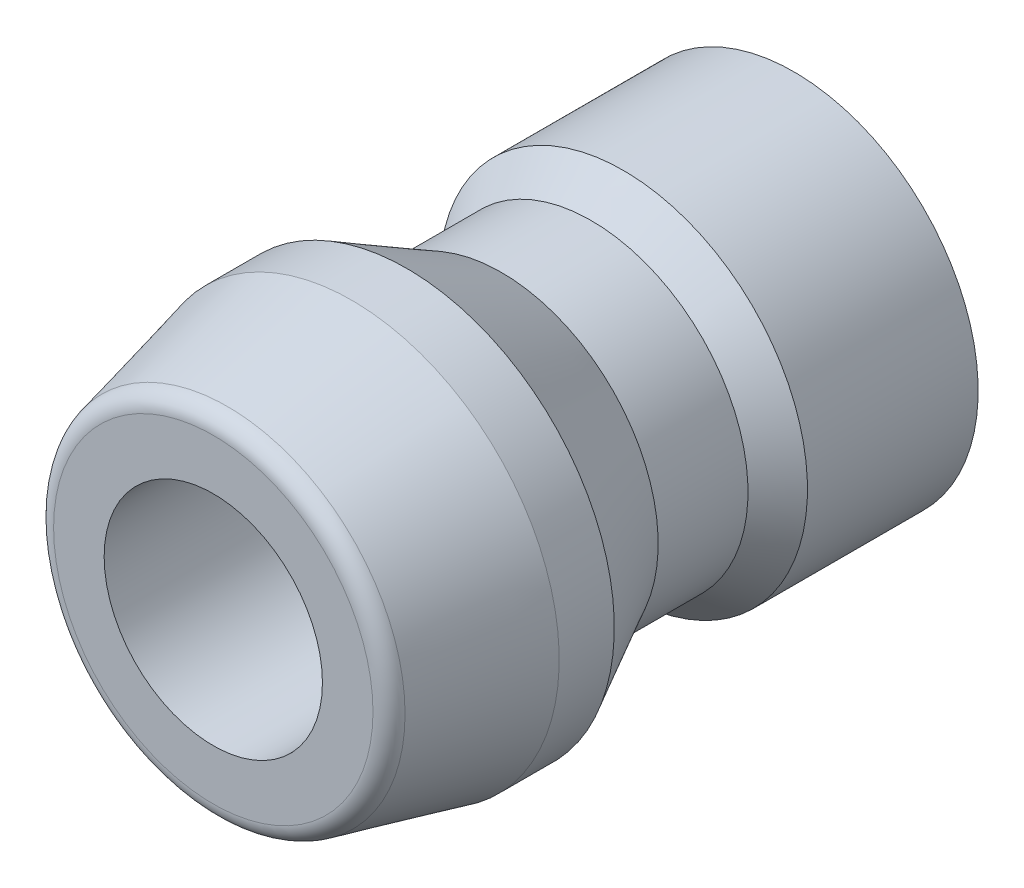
ISO-10303-21;
HEADER;
FILE_DESCRIPTION(('STEP AP214'),'2;1');
FILE_NAME('part.step','',(''),(''),'','','');
FILE_SCHEMA(('AUTOMOTIVE_DESIGN { 1 0 10303 214 1 1 1 1 }'));
ENDSEC;
DATA;
#1=APPLICATION_CONTEXT('core data for automotive mechanical design processes');
#2=APPLICATION_PROTOCOL_DEFINITION('international standard','automotive_design',2000,#1);
#3=PRODUCT_CONTEXT('',#1,'mechanical');
#4=PRODUCT('Part','Part','',(#3));
#5=PRODUCT_RELATED_PRODUCT_CATEGORY('part','',(#4));
#6=PRODUCT_DEFINITION_FORMATION('','',#4);
#7=PRODUCT_DEFINITION_CONTEXT('part definition',#1,'design');
#8=PRODUCT_DEFINITION('design','',#6,#7);
#9=PRODUCT_DEFINITION_SHAPE('','',#8);
#10=(LENGTH_UNIT() NAMED_UNIT(*) SI_UNIT(.MILLI.,.METRE.));
#11=(NAMED_UNIT(*) PLANE_ANGLE_UNIT() SI_UNIT($,.RADIAN.));
#12=(NAMED_UNIT(*) SI_UNIT($,.STERADIAN.) SOLID_ANGLE_UNIT());
#13=UNCERTAINTY_MEASURE_WITH_UNIT(LENGTH_MEASURE(1.E-05),#10,'distance_accuracy_value','');
#14=(GEOMETRIC_REPRESENTATION_CONTEXT(3) GLOBAL_UNCERTAINTY_ASSIGNED_CONTEXT((#13)) GLOBAL_UNIT_ASSIGNED_CONTEXT((#10,
#11,#12)) REPRESENTATION_CONTEXT('',''));
#15=CARTESIAN_POINT('',(0.,0.,0.));
#16=DIRECTION('',(0.,0.,1.));
#17=DIRECTION('',(1.,0.,0.));
#18=AXIS2_PLACEMENT_3D('',#15,#16,#17);
#19=CARTESIAN_POINT('',(0.,0.,0.));
#20=DIRECTION('',(0.,0.,1.));
#21=DIRECTION('',(1.,0.,0.));
#22=AXIS2_PLACEMENT_3D('',#19,#20,#21);
#23=PLANE('',#22);
#24=CARTESIAN_POINT('',(0.,0.,0.));
#25=DIRECTION('',(0.,0.,-1.));
#26=DIRECTION('',(-1.,0.,0.));
#27=AXIS2_PLACEMENT_3D('',#24,#25,#26);
#28=CIRCLE('',#27,9.98484848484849);
#29=CARTESIAN_POINT('',(-9.98484848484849,0.,0.));
#30=VERTEX_POINT('',#29);
#31=EDGE_CURVE('E50',#30,#30,#28,.T.);
#32=ORIENTED_EDGE('',*,*,#31,.T.);
#33=EDGE_LOOP('',(#32));
#34=FACE_BOUND('',#33,.T.);
#35=CARTESIAN_POINT('',(0.,0.,0.));
#36=DIRECTION('',(0.,0.,1.));
#37=DIRECTION('',(1.,0.,0.));
#38=AXIS2_PLACEMENT_3D('',#35,#36,#37);
#39=CIRCLE('',#38,8.5);
#40=CARTESIAN_POINT('',(8.5,0.,0.));
#41=VERTEX_POINT('',#40);
#42=EDGE_CURVE('E62',#41,#41,#39,.T.);
#43=ORIENTED_EDGE('',*,*,#42,.T.);
#44=EDGE_LOOP('',(#43));
#45=FACE_BOUND('',#44,.T.);
#46=ADVANCED_FACE('F24',(#34,#45),#23,.F.);
#47=CARTESIAN_POINT('',(0.,0.,31.5));
#48=DIRECTION('',(0.,0.,1.));
#49=DIRECTION('',(1.,0.,0.));
#50=AXIS2_PLACEMENT_3D('',#47,#48,#49);
#51=PLANE('',#50);
#52=CARTESIAN_POINT('',(0.,0.,31.5));
#53=DIRECTION('',(0.,0.,1.));
#54=DIRECTION('',(1.,0.,0.));
#55=AXIS2_PLACEMENT_3D('',#52,#53,#54);
#56=CIRCLE('',#55,8.66130879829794);
#57=CARTESIAN_POINT('',(8.66130879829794,0.,31.5));
#58=VERTEX_POINT('',#57);
#59=EDGE_CURVE('E10',#58,#58,#56,.T.);
#60=ORIENTED_EDGE('',*,*,#59,.T.);
#61=EDGE_LOOP('',(#60));
#62=FACE_BOUND('',#61,.T.);
#63=CARTESIAN_POINT('',(0.,0.,31.5));
#64=DIRECTION('',(0.,0.,1.));
#65=DIRECTION('',(1.,0.,0.));
#66=AXIS2_PLACEMENT_3D('',#63,#64,#65);
#67=CIRCLE('',#66,5.92);
#68=CARTESIAN_POINT('',(5.92,0.,31.5));
#69=VERTEX_POINT('',#68);
#70=EDGE_CURVE('E56',#69,#69,#67,.T.);
#71=ORIENTED_EDGE('',*,*,#70,.F.);
#72=EDGE_LOOP('',(#71));
#73=FACE_BOUND('',#72,.T.);
#74=ADVANCED_FACE('F83',(#62,#73),#51,.T.);
#75=CARTESIAN_POINT('',(0.,0.,23.9879832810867));
#76=DIRECTION('',(0.,0.,-1.));
#77=DIRECTION('',(-1.,0.,0.));
#78=AXIS2_PLACEMENT_3D('',#75,#76,#77);
#79=CONICAL_SURFACE('',#78,11.25,0.235181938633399);
#80=CARTESIAN_POINT('',(0.,0.,30.7330199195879));
#81=DIRECTION('',(0.,0.,1.));
#82=DIRECTION('',(1.,0.,0.));
#83=AXIS2_PLACEMENT_3D('',#80,#81,#82);
#84=CIRCLE('',#83,9.63378076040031);
#85=CARTESIAN_POINT('',(9.63378076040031,0.,30.7330199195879));
#86=VERTEX_POINT('',#85);
#87=EDGE_CURVE('E32',#86,#86,#84,.F.);
#88=ORIENTED_EDGE('',*,*,#87,.T.);
#89=EDGE_LOOP('',(#88));
#90=FACE_BOUND('',#89,.T.);
#91=CARTESIAN_POINT('',(0.,0.,23.9879832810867));
#92=DIRECTION('',(0.,0.,-1.));
#93=DIRECTION('',(-1.,0.,0.));
#94=AXIS2_PLACEMENT_3D('',#91,#92,#93);
#95=CIRCLE('',#94,11.25);
#96=CARTESIAN_POINT('',(-11.25,0.,23.9879832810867));
#97=VERTEX_POINT('',#96);
#98=EDGE_CURVE('E47',#97,#97,#95,.T.);
#99=ORIENTED_EDGE('',*,*,#98,.F.);
#100=EDGE_LOOP('',(#99));
#101=FACE_BOUND('',#100,.T.);
#102=ADVANCED_FACE('F89',(#90,#101),#79,.T.);
#103=CARTESIAN_POINT('',(0.,0.,31.5));
#104=DIRECTION('',(0.,0.,-1.));
#105=DIRECTION('',(-1.,0.,0.));
#106=AXIS2_PLACEMENT_3D('',#103,#104,#105);
#107=CYLINDRICAL_SURFACE('',#106,11.25);
#108=ORIENTED_EDGE('',*,*,#98,.T.);
#109=EDGE_LOOP('',(#108));
#110=FACE_BOUND('',#109,.T.);
#111=CARTESIAN_POINT('',(0.,0.,21.));
#112=DIRECTION('',(0.,0.,-1.));
#113=DIRECTION('',(-1.,0.,0.));
#114=AXIS2_PLACEMENT_3D('',#111,#112,#113);
#115=CIRCLE('',#114,11.25);
#116=CARTESIAN_POINT('',(-11.25,0.,21.));
#117=VERTEX_POINT('',#116);
#118=EDGE_CURVE('E44',#117,#117,#115,.T.);
#119=ORIENTED_EDGE('',*,*,#118,.F.);
#120=EDGE_LOOP('',(#119));
#121=FACE_BOUND('',#120,.T.);
#122=ADVANCED_FACE('F26',(#110,#121),#107,.T.);
#123=CARTESIAN_POINT('',(0.,0.,9.25757575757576));
#124=DIRECTION('',(0.,0.,-1.));
#125=DIRECTION('',(-1.,0.,0.));
#126=AXIS2_PLACEMENT_3D('',#123,#124,#125);
#127=CONICAL_SURFACE('',#126,9.98484848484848,0.705754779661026);
#128=CARTESIAN_POINT('',(0.,0.,11.));
#129=DIRECTION('',(0.,0.,-1.));
#130=DIRECTION('',(-1.,0.,0.));
#131=AXIS2_PLACEMENT_3D('',#128,#129,#130);
#132=CIRCLE('',#131,8.5);
#133=CARTESIAN_POINT('',(-8.5,0.,11.));
#134=VERTEX_POINT('',#133);
#135=EDGE_CURVE('E36',#134,#134,#132,.T.);
#136=ORIENTED_EDGE('',*,*,#135,.T.);
#137=EDGE_LOOP('',(#136));
#138=FACE_BOUND('',#137,.T.);
#139=CARTESIAN_POINT('',(0.,0.,9.25757575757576));
#140=DIRECTION('',(0.,0.,-1.));
#141=DIRECTION('',(-1.,0.,0.));
#142=AXIS2_PLACEMENT_3D('',#139,#140,#141);
#143=CIRCLE('',#142,9.98484848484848);
#144=CARTESIAN_POINT('',(-9.98484848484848,0.,9.25757575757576));
#145=VERTEX_POINT('',#144);
#146=EDGE_CURVE('E53',#145,#145,#143,.T.);
#147=ORIENTED_EDGE('',*,*,#146,.F.);
#148=EDGE_LOOP('',(#147));
#149=FACE_BOUND('',#148,.T.);
#150=ADVANCED_FACE('F91',(#138,#149),#127,.T.);
#151=CARTESIAN_POINT('',(0.,0.,0.));
#152=DIRECTION('',(0.,0.,-1.));
#153=DIRECTION('',(-1.,0.,0.));
#154=AXIS2_PLACEMENT_3D('',#151,#152,#153);
#155=CYLINDRICAL_SURFACE('',#154,9.98484848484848);
#156=ORIENTED_EDGE('',*,*,#146,.T.);
#157=EDGE_LOOP('',(#156));
#158=FACE_BOUND('',#157,.T.);
#159=ORIENTED_EDGE('',*,*,#31,.F.);
#160=EDGE_LOOP('',(#159));
#161=FACE_BOUND('',#160,.T.);
#162=ADVANCED_FACE('F94',(#158,#161),#155,.T.);
#163=CARTESIAN_POINT('',(0.,0.,0.));
#164=DIRECTION('',(0.,0.,-1.));
#165=DIRECTION('',(-1.,0.,0.));
#166=AXIS2_PLACEMENT_3D('',#163,#164,#165);
#167=CYLINDRICAL_SURFACE('',#166,8.5);
#168=CARTESIAN_POINT('',(0.,0.,15.8706896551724));
#169=DIRECTION('',(0.,0.,-1.));
#170=DIRECTION('',(-1.,0.,0.));
#171=AXIS2_PLACEMENT_3D('',#168,#169,#170);
#172=CIRCLE('',#171,8.5);
#173=CARTESIAN_POINT('',(-8.5,0.,15.8706896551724));
#174=VERTEX_POINT('',#173);
#175=EDGE_CURVE('E41',#174,#174,#172,.T.);
#176=ORIENTED_EDGE('',*,*,#175,.T.);
#177=EDGE_LOOP('',(#176));
#178=FACE_BOUND('',#177,.T.);
#179=ORIENTED_EDGE('',*,*,#135,.F.);
#180=EDGE_LOOP('',(#179));
#181=FACE_BOUND('',#180,.T.);
#182=ADVANCED_FACE('F96',(#178,#181),#167,.T.);
#183=CARTESIAN_POINT('',(0.,0.,15.8706896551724));
#184=DIRECTION('',(0.,0.,1.));
#185=DIRECTION('',(1.,0.,0.));
#186=AXIS2_PLACEMENT_3D('',#183,#184,#185);
#187=CONICAL_SURFACE('',#186,8.5,0.492135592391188);
#188=ORIENTED_EDGE('',*,*,#118,.T.);
#189=EDGE_LOOP('',(#188));
#190=FACE_BOUND('',#189,.T.);
#191=ORIENTED_EDGE('',*,*,#175,.F.);
#192=EDGE_LOOP('',(#191));
#193=FACE_BOUND('',#192,.T.);
#194=ADVANCED_FACE('F99',(#190,#193),#187,.T.);
#195=CARTESIAN_POINT('',(0.,0.,30.5));
#196=DIRECTION('',(0.,0.,1.));
#197=DIRECTION('',(1.,0.,0.));
#198=AXIS2_PLACEMENT_3D('',#195,#196,#197);
#199=TOROIDAL_SURFACE('',#198,8.66130879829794,1.);
#200=ORIENTED_EDGE('',*,*,#59,.F.);
#201=EDGE_LOOP('',(#200));
#202=FACE_BOUND('',#201,.T.);
#203=ORIENTED_EDGE('',*,*,#87,.F.);
#204=EDGE_LOOP('',(#203));
#205=FACE_BOUND('',#204,.T.);
#206=ADVANCED_FACE('F79',(#202,#205),#199,.T.);
#207=CARTESIAN_POINT('',(0.,0.,31.5));
#208=DIRECTION('',(0.,0.,-1.));
#209=DIRECTION('',(-1.,0.,0.));
#210=AXIS2_PLACEMENT_3D('',#207,#208,#209);
#211=CYLINDRICAL_SURFACE('',#210,5.92);
#212=CARTESIAN_POINT('',(0.,0.,7.5));
#213=DIRECTION('',(0.,0.,1.));
#214=DIRECTION('',(1.,0.,0.));
#215=AXIS2_PLACEMENT_3D('',#212,#213,#214);
#216=CIRCLE('',#215,5.92);
#217=CARTESIAN_POINT('',(5.92,0.,7.5));
#218=VERTEX_POINT('',#217);
#219=EDGE_CURVE('E28',#218,#218,#216,.T.);
#220=ORIENTED_EDGE('',*,*,#219,.F.);
#221=EDGE_LOOP('',(#220));
#222=FACE_BOUND('',#221,.T.);
#223=ORIENTED_EDGE('',*,*,#70,.T.);
#224=EDGE_LOOP('',(#223));
#225=FACE_BOUND('',#224,.T.);
#226=ADVANCED_FACE('F70',(#222,#225),#211,.F.);
#227=CARTESIAN_POINT('',(0.,0.,7.5));
#228=DIRECTION('',(0.,0.,-1.));
#229=DIRECTION('',(-1.,0.,0.));
#230=AXIS2_PLACEMENT_3D('',#227,#228,#229);
#231=CYLINDRICAL_SURFACE('',#230,8.5);
#232=CARTESIAN_POINT('',(0.,0.,7.5));
#233=DIRECTION('',(0.,0.,1.));
#234=DIRECTION('',(1.,0.,0.));
#235=AXIS2_PLACEMENT_3D('',#232,#233,#234);
#236=CIRCLE('',#235,8.5);
#237=CARTESIAN_POINT('',(8.5,0.,7.5));
#238=VERTEX_POINT('',#237);
#239=EDGE_CURVE('E59',#238,#238,#236,.T.);
#240=ORIENTED_EDGE('',*,*,#239,.T.);
#241=EDGE_LOOP('',(#240));
#242=FACE_BOUND('',#241,.T.);
#243=ORIENTED_EDGE('',*,*,#42,.F.);
#244=EDGE_LOOP('',(#243));
#245=FACE_BOUND('',#244,.T.);
#246=ADVANCED_FACE('F67',(#242,#245),#231,.F.);
#247=CARTESIAN_POINT('',(0.,0.,7.5));
#248=DIRECTION('',(0.,0.,1.));
#249=DIRECTION('',(1.,0.,0.));
#250=AXIS2_PLACEMENT_3D('',#247,#248,#249);
#251=PLANE('',#250);
#252=ORIENTED_EDGE('',*,*,#219,.T.);
#253=EDGE_LOOP('',(#252));
#254=FACE_BOUND('',#253,.T.);
#255=ORIENTED_EDGE('',*,*,#239,.F.);
#256=EDGE_LOOP('',(#255));
#257=FACE_BOUND('',#256,.T.);
#258=ADVANCED_FACE('F69',(#254,#257),#251,.F.);
#259=CLOSED_SHELL('',(#46,#74,#102,#122,#150,#162,#182,#194,#206,#226,#246,#258));
#260=MANIFOLD_SOLID_BREP('B2',#259);
#261=ADVANCED_BREP_SHAPE_REPRESENTATION('',(#18,#260),#14);
#262=SHAPE_DEFINITION_REPRESENTATION(#9,#261);
ENDSEC;
END-ISO-10303-21;
